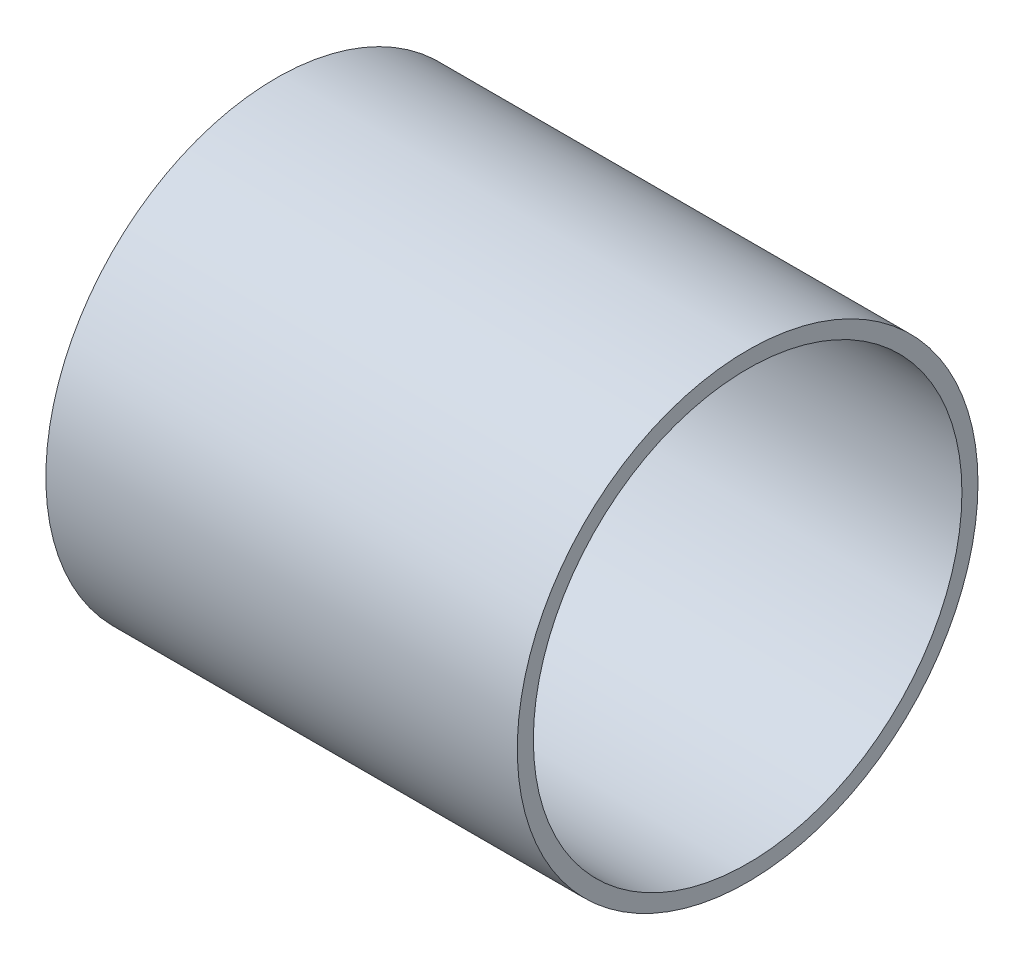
ISO-10303-21;
HEADER;
FILE_DESCRIPTION(('STEP AP214'),'2;1');
FILE_NAME('part.step','',(''),(''),'','','');
FILE_SCHEMA(('AUTOMOTIVE_DESIGN { 1 0 10303 214 1 1 1 1 }'));
ENDSEC;
DATA;
#1=APPLICATION_CONTEXT('core data for automotive mechanical design processes');
#2=APPLICATION_PROTOCOL_DEFINITION('international standard','automotive_design',2000,#1);
#3=PRODUCT_CONTEXT('',#1,'mechanical');
#4=PRODUCT('Part','Part','',(#3));
#5=PRODUCT_RELATED_PRODUCT_CATEGORY('part','',(#4));
#6=PRODUCT_DEFINITION_FORMATION('','',#4);
#7=PRODUCT_DEFINITION_CONTEXT('part definition',#1,'design');
#8=PRODUCT_DEFINITION('design','',#6,#7);
#9=PRODUCT_DEFINITION_SHAPE('','',#8);
#10=(LENGTH_UNIT() NAMED_UNIT(*) SI_UNIT(.MILLI.,.METRE.));
#11=(NAMED_UNIT(*) PLANE_ANGLE_UNIT() SI_UNIT($,.RADIAN.));
#12=(NAMED_UNIT(*) SI_UNIT($,.STERADIAN.) SOLID_ANGLE_UNIT());
#13=UNCERTAINTY_MEASURE_WITH_UNIT(LENGTH_MEASURE(1.E-05),#10,'distance_accuracy_value','');
#14=(GEOMETRIC_REPRESENTATION_CONTEXT(3) GLOBAL_UNCERTAINTY_ASSIGNED_CONTEXT((#13)) GLOBAL_UNIT_ASSIGNED_CONTEXT((#10,
#11,#12)) REPRESENTATION_CONTEXT('',''));
#15=CARTESIAN_POINT('',(0.,0.,0.));
#16=DIRECTION('',(0.,0.,1.));
#17=DIRECTION('',(1.,0.,0.));
#18=AXIS2_PLACEMENT_3D('',#15,#16,#17);
#19=CARTESIAN_POINT('',(279.4,0.,0.));
#20=DIRECTION('',(1.,0.,0.));
#21=DIRECTION('',(0.,0.,-1.));
#22=AXIS2_PLACEMENT_3D('',#19,#20,#21);
#23=PLANE('',#22);
#24=CARTESIAN_POINT('',(279.4,0.,0.));
#25=DIRECTION('',(1.,0.,0.));
#26=DIRECTION('',(0.,0.,-1.));
#27=AXIS2_PLACEMENT_3D('',#24,#25,#26);
#28=CIRCLE('',#27,136.525);
#29=CARTESIAN_POINT('',(279.4,0.,-136.525));
#30=VERTEX_POINT('',#29);
#31=EDGE_CURVE('E10',#30,#30,#28,.T.);
#32=ORIENTED_EDGE('',*,*,#31,.T.);
#33=EDGE_LOOP('',(#32));
#34=FACE_BOUND('',#33,.T.);
#35=CARTESIAN_POINT('',(279.4,0.,0.));
#36=DIRECTION('',(1.,0.,0.));
#37=DIRECTION('',(0.,0.,-1.));
#38=AXIS2_PLACEMENT_3D('',#35,#36,#37);
#39=CIRCLE('',#38,127.);
#40=CARTESIAN_POINT('',(279.4,0.,-127.));
#41=VERTEX_POINT('',#40);
#42=EDGE_CURVE('E39',#41,#41,#39,.T.);
#43=ORIENTED_EDGE('',*,*,#42,.F.);
#44=EDGE_LOOP('',(#43));
#45=FACE_BOUND('',#44,.T.);
#46=ADVANCED_FACE('F28',(#34,#45),#23,.T.);
#47=CARTESIAN_POINT('',(0.,0.,0.));
#48=DIRECTION('',(1.,0.,0.));
#49=DIRECTION('',(0.,0.,-1.));
#50=AXIS2_PLACEMENT_3D('',#47,#48,#49);
#51=PLANE('',#50);
#52=CARTESIAN_POINT('',(0.,0.,0.));
#53=DIRECTION('',(1.,0.,0.));
#54=DIRECTION('',(0.,0.,-1.));
#55=AXIS2_PLACEMENT_3D('',#52,#53,#54);
#56=CIRCLE('',#55,136.525);
#57=CARTESIAN_POINT('',(0.,0.,-136.525));
#58=VERTEX_POINT('',#57);
#59=EDGE_CURVE('E32',#58,#58,#56,.T.);
#60=ORIENTED_EDGE('',*,*,#59,.F.);
#61=EDGE_LOOP('',(#60));
#62=FACE_BOUND('',#61,.T.);
#63=CARTESIAN_POINT('',(0.,0.,0.));
#64=DIRECTION('',(1.,0.,0.));
#65=DIRECTION('',(0.,0.,-1.));
#66=AXIS2_PLACEMENT_3D('',#63,#64,#65);
#67=CIRCLE('',#66,127.);
#68=CARTESIAN_POINT('',(0.,0.,-127.));
#69=VERTEX_POINT('',#68);
#70=EDGE_CURVE('E41',#69,#69,#67,.T.);
#71=ORIENTED_EDGE('',*,*,#70,.T.);
#72=EDGE_LOOP('',(#71));
#73=FACE_BOUND('',#72,.T.);
#74=ADVANCED_FACE('F51',(#62,#73),#51,.F.);
#75=CARTESIAN_POINT('',(279.4,0.,0.));
#76=DIRECTION('',(-1.,0.,0.));
#77=DIRECTION('',(0.,0.,1.));
#78=AXIS2_PLACEMENT_3D('',#75,#76,#77);
#79=CYLINDRICAL_SURFACE('',#78,136.525);
#80=ORIENTED_EDGE('',*,*,#31,.F.);
#81=EDGE_LOOP('',(#80));
#82=FACE_BOUND('',#81,.T.);
#83=ORIENTED_EDGE('',*,*,#59,.T.);
#84=EDGE_LOOP('',(#83));
#85=FACE_BOUND('',#84,.T.);
#86=ADVANCED_FACE('F30',(#82,#85),#79,.T.);
#87=CARTESIAN_POINT('',(279.4,0.,0.));
#88=DIRECTION('',(-1.,0.,0.));
#89=DIRECTION('',(0.,0.,1.));
#90=AXIS2_PLACEMENT_3D('',#87,#88,#89);
#91=CYLINDRICAL_SURFACE('',#90,127.);
#92=ORIENTED_EDGE('',*,*,#42,.T.);
#93=EDGE_LOOP('',(#92));
#94=FACE_BOUND('',#93,.T.);
#95=ORIENTED_EDGE('',*,*,#70,.F.);
#96=EDGE_LOOP('',(#95));
#97=FACE_BOUND('',#96,.T.);
#98=ADVANCED_FACE('F47',(#94,#97),#91,.F.);
#99=CLOSED_SHELL('',(#46,#74,#86,#98));
#100=MANIFOLD_SOLID_BREP('B2',#99);
#101=ADVANCED_BREP_SHAPE_REPRESENTATION('',(#18,#100),#14);
#102=SHAPE_DEFINITION_REPRESENTATION(#9,#101);
ENDSEC;
END-ISO-10303-21;
